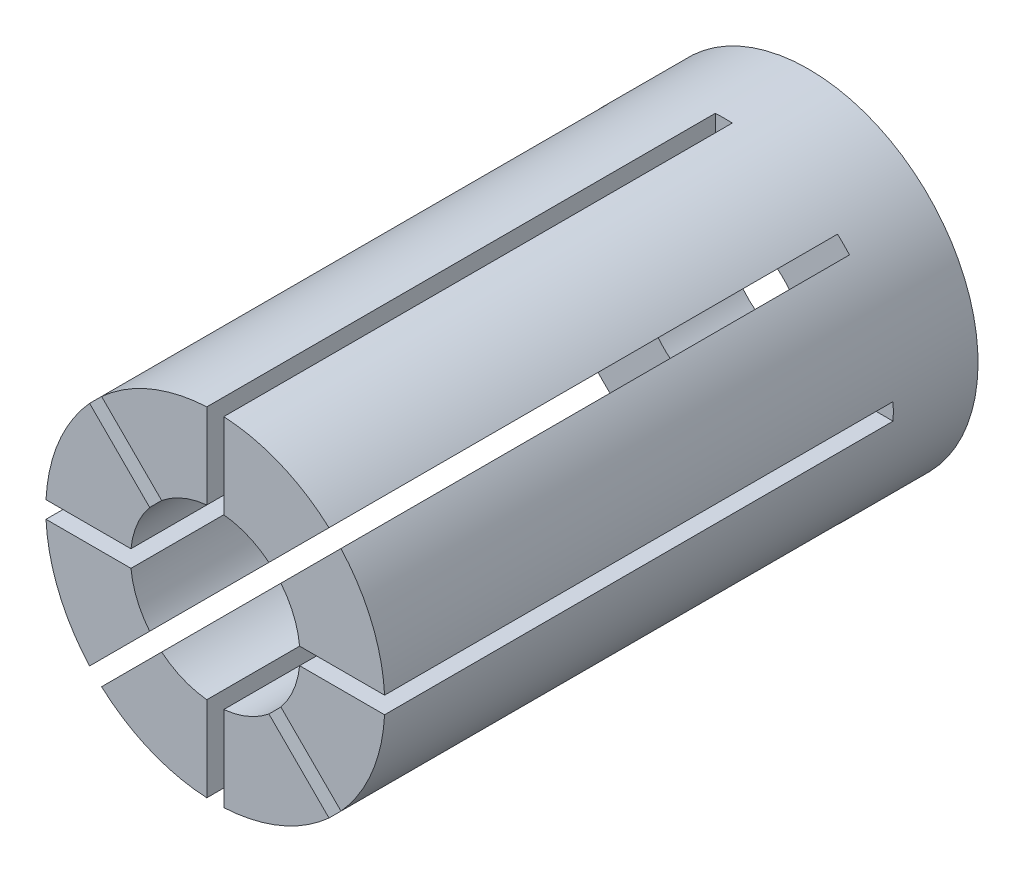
ISO-10303-21;
HEADER;
FILE_DESCRIPTION(('STEP AP214'),'2;1');
FILE_NAME('part.step','',(''),(''),'','','');
FILE_SCHEMA(('AUTOMOTIVE_DESIGN { 1 0 10303 214 1 1 1 1 }'));
ENDSEC;
DATA;
#1=APPLICATION_CONTEXT('core data for automotive mechanical design processes');
#2=APPLICATION_PROTOCOL_DEFINITION('international standard','automotive_design',2000,#1);
#3=PRODUCT_CONTEXT('',#1,'mechanical');
#4=PRODUCT('Part','Part','',(#3));
#5=PRODUCT_RELATED_PRODUCT_CATEGORY('part','',(#4));
#6=PRODUCT_DEFINITION_FORMATION('','',#4);
#7=PRODUCT_DEFINITION_CONTEXT('part definition',#1,'design');
#8=PRODUCT_DEFINITION('design','',#6,#7);
#9=PRODUCT_DEFINITION_SHAPE('','',#8);
#10=(LENGTH_UNIT() NAMED_UNIT(*) SI_UNIT(.MILLI.,.METRE.));
#11=(NAMED_UNIT(*) PLANE_ANGLE_UNIT() SI_UNIT($,.RADIAN.));
#12=(NAMED_UNIT(*) SI_UNIT($,.STERADIAN.) SOLID_ANGLE_UNIT());
#13=UNCERTAINTY_MEASURE_WITH_UNIT(LENGTH_MEASURE(1.E-05),#10,'distance_accuracy_value','');
#14=(GEOMETRIC_REPRESENTATION_CONTEXT(3) GLOBAL_UNCERTAINTY_ASSIGNED_CONTEXT((#13)) GLOBAL_UNIT_ASSIGNED_CONTEXT((#10,
#11,#12)) REPRESENTATION_CONTEXT('',''));
#15=CARTESIAN_POINT('',(0.,0.,0.));
#16=DIRECTION('',(0.,0.,1.));
#17=DIRECTION('',(1.,0.,0.));
#18=AXIS2_PLACEMENT_3D('',#15,#16,#17);
#19=CARTESIAN_POINT('',(0.998749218,0.05,0.5));
#20=DIRECTION('',(0.,1.,0.));
#21=DIRECTION('',(-1.,0.,0.));
#22=AXIS2_PLACEMENT_3D('',#19,#20,#21);
#23=PLANE('',#22);
#24=DIRECTION('',(0.,0.,1.));
#25=VECTOR('',#24,1.);
#26=CARTESIAN_POINT('',(0.497493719,0.05,2.));
#27=LINE('',#26,#25);
#28=CARTESIAN_POINT('',(0.497493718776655,0.05,0.50000000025));
#29=VERTEX_POINT('',#28);
#30=CARTESIAN_POINT('',(0.497493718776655,0.05,3.5));
#31=VERTEX_POINT('',#30);
#32=EDGE_CURVE('E281',#29,#31,#27,.T.);
#33=ORIENTED_EDGE('',*,*,#32,.F.);
#34=DIRECTION('',(-1.,0.,0.));
#35=VECTOR('',#34,1.);
#36=CARTESIAN_POINT('',(0.7481214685,0.05,0.5));
#37=LINE('',#36,#35);
#38=CARTESIAN_POINT('',(0.998749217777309,0.0499999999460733,0.50000000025));
#39=VERTEX_POINT('',#38);
#40=EDGE_CURVE('E253',#39,#29,#37,.T.);
#41=ORIENTED_EDGE('',*,*,#40,.F.);
#42=DIRECTION('',(0.,0.,-1.));
#43=VECTOR('',#42,1.);
#44=CARTESIAN_POINT('',(0.998749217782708,0.0499999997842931,1.75));
#45=LINE('',#44,#43);
#46=CARTESIAN_POINT('',(0.998749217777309,0.0499999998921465,3.5));
#47=VERTEX_POINT('',#46);
#48=EDGE_CURVE('E376',#39,#47,#45,.F.);
#49=ORIENTED_EDGE('',*,*,#48,.T.);
#50=DIRECTION('',(1.,0.,0.));
#51=VECTOR('',#50,1.);
#52=CARTESIAN_POINT('',(0.6929428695,0.05,3.5));
#53=LINE('',#52,#51);
#54=EDGE_CURVE('E283',#31,#47,#53,.T.);
#55=ORIENTED_EDGE('',*,*,#54,.F.);
#56=EDGE_LOOP('',(#33,#41,#49,#55));
#57=FACE_BOUND('',#56,.T.);
#58=ADVANCED_FACE('F17',(#57),#23,.F.);
#59=CARTESIAN_POINT('',(0.383466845,0.05,3.5));
#60=DIRECTION('',(0.,0.,1.));
#61=DIRECTION('',(1.,0.,0.));
#62=AXIS2_PLACEMENT_3D('',#59,#60,#61);
#63=PLANE('',#62);
#64=DIRECTION('',(-0.707106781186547,-0.707106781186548,0.));
#65=VECTOR('',#64,1.);
#66=CARTESIAN_POINT('',(0.5643571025,0.4936464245,3.5));
#67=LINE('',#66,#65);
#68=CARTESIAN_POINT('',(0.741577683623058,0.670867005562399,3.5));
#69=VERTEX_POINT('',#68);
#70=CARTESIAN_POINT('',(0.38713652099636,0.31642584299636,3.5));
#71=VERTEX_POINT('',#70);
#72=EDGE_CURVE('E280',#69,#71,#67,.T.);
#73=ORIENTED_EDGE('',*,*,#72,.T.);
#74=CARTESIAN_POINT('',(0.,0.,3.5));
#75=DIRECTION('',(0.,0.,-1.));
#76=DIRECTION('',(0.,1.,0.));
#77=AXIS2_PLACEMENT_3D('',#74,#75,#76);
#78=CIRCLE('',#77,0.5);
#79=EDGE_CURVE('E21',#71,#31,#78,.T.);
#80=ORIENTED_EDGE('',*,*,#79,.T.);
#81=ORIENTED_EDGE('',*,*,#54,.T.);
#82=CARTESIAN_POINT('',(0.,0.,3.5));
#83=DIRECTION('',(0.,0.,-1.));
#84=DIRECTION('',(0.,1.,0.));
#85=AXIS2_PLACEMENT_3D('',#82,#83,#84);
#86=CIRCLE('',#85,1.);
#87=EDGE_CURVE('E374',#47,#69,#86,.F.);
#88=ORIENTED_EDGE('',*,*,#87,.T.);
#89=EDGE_LOOP('',(#73,#80,#81,#88));
#90=FACE_BOUND('',#89,.T.);
#91=ADVANCED_FACE('F482',(#90),#63,.T.);
#92=CARTESIAN_POINT('',(0.387136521,0.316425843,0.5));
#93=DIRECTION('',(0.707106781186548,-0.707106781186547,0.));
#94=DIRECTION('',(0.707106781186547,0.707106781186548,0.));
#95=AXIS2_PLACEMENT_3D('',#92,#93,#94);
#96=PLANE('',#95);
#97=DIRECTION('',(0.,0.,1.));
#98=VECTOR('',#97,1.);
#99=CARTESIAN_POINT('',(0.741577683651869,0.670867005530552,1.75));
#100=LINE('',#99,#98);
#101=CARTESIAN_POINT('',(0.741577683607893,0.670867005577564,0.50000000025));
#102=VERTEX_POINT('',#101);
#103=EDGE_CURVE('E373',#69,#102,#100,.F.);
#104=ORIENTED_EDGE('',*,*,#103,.T.);
#105=DIRECTION('',(0.707106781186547,0.707106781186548,0.));
#106=VECTOR('',#105,1.);
#107=CARTESIAN_POINT('',(0.5647993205,0.4940886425,0.5));
#108=LINE('',#107,#106);
#109=CARTESIAN_POINT('',(0.38713652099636,0.31642584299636,0.50000000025));
#110=VERTEX_POINT('',#109);
#111=EDGE_CURVE('E389',#110,#102,#108,.T.);
#112=ORIENTED_EDGE('',*,*,#111,.F.);
#113=DIRECTION('',(0.,0.,-1.));
#114=VECTOR('',#113,1.);
#115=CARTESIAN_POINT('',(0.387136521,0.316425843,2.));
#116=LINE('',#115,#114);
#117=EDGE_CURVE('E277',#71,#110,#116,.T.);
#118=ORIENTED_EDGE('',*,*,#117,.F.);
#119=ORIENTED_EDGE('',*,*,#72,.F.);
#120=EDGE_LOOP('',(#104,#112,#118,#119));
#121=FACE_BOUND('',#120,.T.);
#122=ADVANCED_FACE('F496',(#121),#96,.F.);
#123=CARTESIAN_POINT('',(0.314293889,0.385004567,0.5));
#124=DIRECTION('',(0.,0.,1.));
#125=DIRECTION('',(0.707106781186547,-0.707106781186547,0.));
#126=AXIS2_PLACEMENT_3D('',#123,#124,#125);
#127=PLANE('',#126);
#128=CARTESIAN_POINT('',(0.,0.,0.500000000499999));
#129=DIRECTION('',(0.,0.,-1.));
#130=DIRECTION('',(0.,1.,0.));
#131=AXIS2_PLACEMENT_3D('',#128,#129,#130);
#132=CIRCLE('',#131,0.5);
#133=CARTESIAN_POINT('',(0.31642584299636,0.38713652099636,0.50000000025));
#134=VERTEX_POINT('',#133);
#135=EDGE_CURVE('E388',#134,#110,#132,.T.);
#136=ORIENTED_EDGE('',*,*,#135,.T.);
#137=ORIENTED_EDGE('',*,*,#111,.T.);
#138=CARTESIAN_POINT('',(0.,0.,0.500000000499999));
#139=DIRECTION('',(0.,0.,-1.));
#140=DIRECTION('',(0.,1.,0.));
#141=AXIS2_PLACEMENT_3D('',#138,#139,#140);
#142=CIRCLE('',#141,1.);
#143=CARTESIAN_POINT('',(0.670867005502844,0.741577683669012,0.50000000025));
#144=VERTEX_POINT('',#143);
#145=EDGE_CURVE('E370',#102,#144,#142,.F.);
#146=ORIENTED_EDGE('',*,*,#145,.T.);
#147=DIRECTION('',(-0.707106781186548,-0.707106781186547,0.));
#148=VECTOR('',#147,1.);
#149=CARTESIAN_POINT('',(0.4936464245,0.5643571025,0.5));
#150=LINE('',#149,#148);
#151=EDGE_CURVE('E276',#144,#134,#150,.T.);
#152=ORIENTED_EDGE('',*,*,#151,.T.);
#153=EDGE_LOOP('',(#136,#137,#146,#152));
#154=FACE_BOUND('',#153,.T.);
#155=ADVANCED_FACE('F502',(#154),#127,.T.);
#156=CARTESIAN_POINT('',(0.670867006,0.741577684,0.5));
#157=DIRECTION('',(-0.707106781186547,0.707106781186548,0.));
#158=DIRECTION('',(-0.707106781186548,-0.707106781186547,0.));
#159=AXIS2_PLACEMENT_3D('',#156,#157,#158);
#160=PLANE('',#159);
#161=DIRECTION('',(0.,0.,1.));
#162=VECTOR('',#161,1.);
#163=CARTESIAN_POINT('',(0.316425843,0.387136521,2.));
#164=LINE('',#163,#162);
#165=CARTESIAN_POINT('',(0.316425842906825,0.387136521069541,3.5));
#166=VERTEX_POINT('',#165);
#167=EDGE_CURVE('E273',#134,#166,#164,.T.);
#168=ORIENTED_EDGE('',*,*,#167,.F.);
#169=ORIENTED_EDGE('',*,*,#151,.F.);
#170=DIRECTION('',(0.,0.,-1.));
#171=VECTOR('',#170,1.);
#172=CARTESIAN_POINT('',(0.670867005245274,0.741577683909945,1.75));
#173=LINE('',#172,#171);
#174=CARTESIAN_POINT('',(0.670867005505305,0.741577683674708,3.5));
#175=VERTEX_POINT('',#174);
#176=EDGE_CURVE('E369',#144,#175,#173,.F.);
#177=ORIENTED_EDGE('',*,*,#176,.T.);
#178=DIRECTION('',(0.707106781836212,0.707106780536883,0.));
#179=VECTOR('',#178,1.);
#180=CARTESIAN_POINT('',(0.31642584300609,0.387136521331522,3.5));
#181=LINE('',#180,#179);
#182=EDGE_CURVE('E275',#166,#175,#181,.T.);
#183=ORIENTED_EDGE('',*,*,#182,.F.);
#184=EDGE_LOOP('',(#168,#169,#177,#183));
#185=FACE_BOUND('',#184,.T.);
#186=ADVANCED_FACE('F501',(#185),#160,.F.);
#187=CARTESIAN_POINT('',(0.05,0.383466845,3.5));
#188=DIRECTION('',(0.,0.,1.));
#189=DIRECTION('',(1.,0.,0.));
#190=AXIS2_PLACEMENT_3D('',#187,#188,#189);
#191=PLANE('',#190);
#192=DIRECTION('',(0.,-1.,0.));
#193=VECTOR('',#192,1.);
#194=CARTESIAN_POINT('',(0.05,0.7481214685,3.5));
#195=LINE('',#194,#193);
#196=CARTESIAN_POINT('',(0.0500000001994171,0.998749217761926,3.5));
#197=VERTEX_POINT('',#196);
#198=CARTESIAN_POINT('',(0.05,0.497493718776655,3.5));
#199=VERTEX_POINT('',#198);
#200=EDGE_CURVE('E271',#197,#199,#195,.T.);
#201=ORIENTED_EDGE('',*,*,#200,.T.);
#202=CARTESIAN_POINT('',(0.,0.,3.5));
#203=DIRECTION('',(0.,0.,-1.));
#204=DIRECTION('',(0.,1.,0.));
#205=AXIS2_PLACEMENT_3D('',#202,#203,#204);
#206=CIRCLE('',#205,0.5);
#207=EDGE_CURVE('E272',#199,#166,#206,.T.);
#208=ORIENTED_EDGE('',*,*,#207,.T.);
#209=ORIENTED_EDGE('',*,*,#182,.T.);
#210=CARTESIAN_POINT('',(0.,0.,3.5));
#211=DIRECTION('',(0.,0.,-1.));
#212=DIRECTION('',(0.,1.,0.));
#213=AXIS2_PLACEMENT_3D('',#210,#211,#212);
#214=CIRCLE('',#213,1.);
#215=EDGE_CURVE('E366',#175,#197,#214,.F.);
#216=ORIENTED_EDGE('',*,*,#215,.T.);
#217=EDGE_LOOP('',(#201,#208,#209,#216));
#218=FACE_BOUND('',#217,.T.);
#219=ADVANCED_FACE('F510',(#218),#191,.T.);
#220=CARTESIAN_POINT('',(0.05,0.497493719,0.5));
#221=DIRECTION('',(1.,0.,0.));
#222=DIRECTION('',(0.,1.,0.));
#223=AXIS2_PLACEMENT_3D('',#220,#221,#222);
#224=PLANE('',#223);
#225=DIRECTION('',(0.,0.,1.));
#226=VECTOR('',#225,1.);
#227=CARTESIAN_POINT('',(0.0500000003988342,0.998749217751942,1.75));
#228=LINE('',#227,#226);
#229=CARTESIAN_POINT('',(0.0500000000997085,0.998749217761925,0.50000000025));
#230=VERTEX_POINT('',#229);
#231=EDGE_CURVE('E365',#197,#230,#228,.F.);
#232=ORIENTED_EDGE('',*,*,#231,.T.);
#233=DIRECTION('',(0.,1.,0.));
#234=VECTOR('',#233,1.);
#235=CARTESIAN_POINT('',(0.05,0.7487468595,0.5));
#236=LINE('',#235,#234);
#237=CARTESIAN_POINT('',(0.05,0.497493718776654,0.50000000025));
#238=VERTEX_POINT('',#237);
#239=EDGE_CURVE('E385',#238,#230,#236,.T.);
#240=ORIENTED_EDGE('',*,*,#239,.F.);
#241=DIRECTION('',(0.,0.,-1.));
#242=VECTOR('',#241,1.);
#243=CARTESIAN_POINT('',(0.05,0.497493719,2.));
#244=LINE('',#243,#242);
#245=EDGE_CURVE('E268',#199,#238,#244,.T.);
#246=ORIENTED_EDGE('',*,*,#245,.F.);
#247=ORIENTED_EDGE('',*,*,#200,.F.);
#248=EDGE_LOOP('',(#232,#240,#246,#247));
#249=FACE_BOUND('',#248,.T.);
#250=ADVANCED_FACE('F542',(#249),#224,.F.);
#251=CARTESIAN_POINT('',(-0.05,0.494478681,0.5));
#252=DIRECTION('',(0.,0.,1.));
#253=DIRECTION('',(1.,0.,0.));
#254=AXIS2_PLACEMENT_3D('',#251,#252,#253);
#255=PLANE('',#254);
#256=CARTESIAN_POINT('',(0.,0.,0.500000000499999));
#257=DIRECTION('',(0.,0.,-1.));
#258=DIRECTION('',(0.,1.,0.));
#259=AXIS2_PLACEMENT_3D('',#256,#257,#258);
#260=CIRCLE('',#259,0.5);
#261=CARTESIAN_POINT('',(-0.05,0.497493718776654,0.50000000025));
#262=VERTEX_POINT('',#261);
#263=EDGE_CURVE('E383',#262,#238,#260,.T.);
#264=ORIENTED_EDGE('',*,*,#263,.T.);
#265=ORIENTED_EDGE('',*,*,#239,.T.);
#266=CARTESIAN_POINT('',(0.,0.,0.500000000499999));
#267=DIRECTION('',(0.,0.,-1.));
#268=DIRECTION('',(0.,1.,0.));
#269=AXIS2_PLACEMENT_3D('',#266,#267,#268);
#270=CIRCLE('',#269,1.);
#271=CARTESIAN_POINT('',(-0.0499999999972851,0.99874921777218,0.50000000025));
#272=VERTEX_POINT('',#271);
#273=EDGE_CURVE('E362',#230,#272,#270,.F.);
#274=ORIENTED_EDGE('',*,*,#273,.T.);
#275=DIRECTION('',(0.,-1.,0.));
#276=VECTOR('',#275,1.);
#277=CARTESIAN_POINT('',(-0.05,0.7481214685,0.5));
#278=LINE('',#277,#276);
#279=EDGE_CURVE('E267',#272,#262,#278,.T.);
#280=ORIENTED_EDGE('',*,*,#279,.T.);
#281=EDGE_LOOP('',(#264,#265,#274,#280));
#282=FACE_BOUND('',#281,.T.);
#283=ADVANCED_FACE('F550',(#282),#255,.T.);
#284=CARTESIAN_POINT('',(-0.05,0.998749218,0.5));
#285=DIRECTION('',(-1.,0.,0.));
#286=DIRECTION('',(0.,-1.,0.));
#287=AXIS2_PLACEMENT_3D('',#284,#285,#286);
#288=PLANE('',#287);
#289=DIRECTION('',(0.,0.,1.));
#290=VECTOR('',#289,1.);
#291=CARTESIAN_POINT('',(-0.05,0.497493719,2.));
#292=LINE('',#291,#290);
#293=CARTESIAN_POINT('',(-0.05,0.497493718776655,3.5));
#294=VERTEX_POINT('',#293);
#295=EDGE_CURVE('E263',#262,#294,#292,.T.);
#296=ORIENTED_EDGE('',*,*,#295,.F.);
#297=ORIENTED_EDGE('',*,*,#279,.F.);
#298=DIRECTION('',(0.,0.,-1.));
#299=VECTOR('',#298,1.);
#300=CARTESIAN_POINT('',(-0.0499999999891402,0.998749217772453,1.75));
#301=LINE('',#300,#299);
#302=CARTESIAN_POINT('',(-0.0499999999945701,0.998749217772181,3.5));
#303=VERTEX_POINT('',#302);
#304=EDGE_CURVE('E361',#272,#303,#301,.F.);
#305=ORIENTED_EDGE('',*,*,#304,.T.);
#306=DIRECTION('',(0.,1.,0.));
#307=VECTOR('',#306,1.);
#308=CARTESIAN_POINT('',(-0.05,0.6929428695,3.5));
#309=LINE('',#308,#307);
#310=EDGE_CURVE('E262',#294,#303,#309,.T.);
#311=ORIENTED_EDGE('',*,*,#310,.F.);
#312=EDGE_LOOP('',(#296,#297,#305,#311));
#313=FACE_BOUND('',#312,.T.);
#314=ADVANCED_FACE('F558',(#313),#288,.F.);
#315=CARTESIAN_POINT('',(-0.674592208,0.383466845,3.5));
#316=DIRECTION('',(0.,0.,1.));
#317=DIRECTION('',(1.,0.,0.));
#318=AXIS2_PLACEMENT_3D('',#315,#316,#317);
#319=PLANE('',#318);
#320=ORIENTED_EDGE('',*,*,#310,.T.);
#321=CARTESIAN_POINT('',(0.,0.,3.5));
#322=DIRECTION('',(0.,0.,-1.));
#323=DIRECTION('',(0.,1.,0.));
#324=AXIS2_PLACEMENT_3D('',#321,#322,#323);
#325=CIRCLE('',#324,1.);
#326=CARTESIAN_POINT('',(-0.670867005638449,0.741577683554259,3.5));
#327=VERTEX_POINT('',#326);
#328=EDGE_CURVE('E358',#303,#327,#325,.F.);
#329=ORIENTED_EDGE('',*,*,#328,.T.);
#330=DIRECTION('',(0.707106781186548,-0.707106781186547,0.));
#331=VECTOR('',#330,1.);
#332=CARTESIAN_POINT('',(-0.4936464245,0.5643571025,3.5));
#333=LINE('',#332,#331);
#334=CARTESIAN_POINT('',(-0.31642584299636,0.38713652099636,3.5));
#335=VERTEX_POINT('',#334);
#336=EDGE_CURVE('E261',#327,#335,#333,.T.);
#337=ORIENTED_EDGE('',*,*,#336,.T.);
#338=CARTESIAN_POINT('',(0.,0.,3.5));
#339=DIRECTION('',(0.,0.,-1.));
#340=DIRECTION('',(0.,1.,0.));
#341=AXIS2_PLACEMENT_3D('',#338,#339,#340);
#342=CIRCLE('',#341,0.5);
#343=EDGE_CURVE('E266',#335,#294,#342,.T.);
#344=ORIENTED_EDGE('',*,*,#343,.T.);
#345=EDGE_LOOP('',(#320,#329,#337,#344));
#346=FACE_BOUND('',#345,.T.);
#347=ADVANCED_FACE('F566',(#346),#319,.T.);
#348=CARTESIAN_POINT('',(-0.316425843,0.387136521,0.5));
#349=DIRECTION('',(0.707106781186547,0.707106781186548,0.));
#350=DIRECTION('',(-0.707106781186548,0.707106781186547,0.));
#351=AXIS2_PLACEMENT_3D('',#348,#349,#350);
#352=PLANE('',#351);
#353=DIRECTION('',(0.,0.,1.));
#354=VECTOR('',#353,1.);
#355=CARTESIAN_POINT('',(-0.670867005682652,0.741577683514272,1.75));
#356=LINE('',#355,#354);
#357=CARTESIAN_POINT('',(-0.670867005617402,0.741577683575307,0.50000000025));
#358=VERTEX_POINT('',#357);
#359=EDGE_CURVE('E357',#327,#358,#356,.F.);
#360=ORIENTED_EDGE('',*,*,#359,.T.);
#361=DIRECTION('',(-0.707106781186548,0.707106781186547,0.));
#362=VECTOR('',#361,1.);
#363=CARTESIAN_POINT('',(-0.4940886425,0.5647993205,0.5));
#364=LINE('',#363,#362);
#365=CARTESIAN_POINT('',(-0.31642584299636,0.38713652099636,0.50000000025));
#366=VERTEX_POINT('',#365);
#367=EDGE_CURVE('E381',#366,#358,#364,.T.);
#368=ORIENTED_EDGE('',*,*,#367,.F.);
#369=DIRECTION('',(0.,0.,-1.));
#370=VECTOR('',#369,1.);
#371=CARTESIAN_POINT('',(-0.316425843,0.387136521,2.));
#372=LINE('',#371,#370);
#373=EDGE_CURVE('E258',#335,#366,#372,.T.);
#374=ORIENTED_EDGE('',*,*,#373,.F.);
#375=ORIENTED_EDGE('',*,*,#336,.F.);
#376=EDGE_LOOP('',(#360,#368,#374,#375));
#377=FACE_BOUND('',#376,.T.);
#378=ADVANCED_FACE('F574',(#377),#352,.F.);
#379=CARTESIAN_POINT('',(-0.385004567,0.314293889,0.5));
#380=DIRECTION('',(0.,0.,1.));
#381=DIRECTION('',(0.707106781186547,0.707106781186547,0.));
#382=AXIS2_PLACEMENT_3D('',#379,#380,#381);
#383=PLANE('',#382);
#384=CARTESIAN_POINT('',(0.,0.,0.500000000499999));
#385=DIRECTION('',(0.,0.,-1.));
#386=DIRECTION('',(0.,1.,0.));
#387=AXIS2_PLACEMENT_3D('',#384,#385,#386);
#388=CIRCLE('',#387,0.5);
#389=CARTESIAN_POINT('',(-0.38713652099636,0.31642584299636,0.50000000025));
#390=VERTEX_POINT('',#389);
#391=EDGE_CURVE('E379',#390,#366,#388,.T.);
#392=ORIENTED_EDGE('',*,*,#391,.T.);
#393=ORIENTED_EDGE('',*,*,#367,.T.);
#394=CARTESIAN_POINT('',(0.,0.,0.500000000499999));
#395=DIRECTION('',(0.,0.,-1.));
#396=DIRECTION('',(0.,1.,0.));
#397=AXIS2_PLACEMENT_3D('',#394,#395,#396);
#398=CIRCLE('',#397,1.);
#399=CARTESIAN_POINT('',(-0.74157768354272,0.67086700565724,0.50000000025));
#400=VERTEX_POINT('',#399);
#401=EDGE_CURVE('E354',#358,#400,#398,.F.);
#402=ORIENTED_EDGE('',*,*,#401,.T.);
#403=DIRECTION('',(0.707106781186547,-0.707106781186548,0.));
#404=VECTOR('',#403,1.);
#405=CARTESIAN_POINT('',(-0.5643571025,0.4936464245,0.5));
#406=LINE('',#405,#404);
#407=EDGE_CURVE('E257',#400,#390,#406,.T.);
#408=ORIENTED_EDGE('',*,*,#407,.T.);
#409=EDGE_LOOP('',(#392,#393,#402,#408));
#410=FACE_BOUND('',#409,.T.);
#411=ADVANCED_FACE('F582',(#410),#383,.T.);
#412=CARTESIAN_POINT('',(-0.741577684,0.670867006,0.5));
#413=DIRECTION('',(-0.707106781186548,-0.707106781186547,0.));
#414=DIRECTION('',(0.707106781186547,-0.707106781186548,0.));
#415=AXIS2_PLACEMENT_3D('',#412,#413,#414);
#416=PLANE('',#415);
#417=DIRECTION('',(0.,0.,1.));
#418=VECTOR('',#417,1.);
#419=CARTESIAN_POINT('',(-0.387136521,0.316425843,2.));
#420=LINE('',#419,#418);
#421=CARTESIAN_POINT('',(-0.387136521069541,0.316425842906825,3.5));
#422=VERTEX_POINT('',#421);
#423=EDGE_CURVE('E255',#390,#422,#420,.T.);
#424=ORIENTED_EDGE('',*,*,#423,.F.);
#425=ORIENTED_EDGE('',*,*,#407,.F.);
#426=DIRECTION('',(0.,0.,-1.));
#427=VECTOR('',#426,1.);
#428=CARTESIAN_POINT('',(-0.741577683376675,0.670867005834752,1.75));
#429=LINE('',#428,#427);
#430=CARTESIAN_POINT('',(-0.741577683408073,0.670867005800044,3.5));
#431=VERTEX_POINT('',#430);
#432=EDGE_CURVE('E353',#400,#431,#429,.F.);
#433=ORIENTED_EDGE('',*,*,#432,.T.);
#434=DIRECTION('',(-0.707106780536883,0.707106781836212,0.));
#435=VECTOR('',#434,1.);
#436=CARTESIAN_POINT('',(-0.387136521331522,0.31642584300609,3.5));
#437=LINE('',#436,#435);
#438=EDGE_CURVE('E249',#422,#431,#437,.T.);
#439=ORIENTED_EDGE('',*,*,#438,.F.);
#440=EDGE_LOOP('',(#424,#425,#433,#439));
#441=FACE_BOUND('',#440,.T.);
#442=ADVANCED_FACE('F590',(#441),#416,.F.);
#443=CARTESIAN_POINT('',(-1.002418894,0.05,3.5));
#444=DIRECTION('',(0.,0.,1.));
#445=DIRECTION('',(1.,0.,0.));
#446=AXIS2_PLACEMENT_3D('',#443,#444,#445);
#447=PLANE('',#446);
#448=DIRECTION('',(1.,0.,0.));
#449=VECTOR('',#448,1.);
#450=CARTESIAN_POINT('',(-0.7481214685,0.05,3.5));
#451=LINE('',#450,#449);
#452=CARTESIAN_POINT('',(-0.998749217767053,0.0500000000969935,3.5));
#453=VERTEX_POINT('',#452);
#454=CARTESIAN_POINT('',(-0.497493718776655,0.05,3.5));
#455=VERTEX_POINT('',#454);
#456=EDGE_CURVE('E240',#453,#455,#451,.T.);
#457=ORIENTED_EDGE('',*,*,#456,.T.);
#458=CARTESIAN_POINT('',(0.,0.,3.5));
#459=DIRECTION('',(0.,0.,-1.));
#460=DIRECTION('',(0.,1.,0.));
#461=AXIS2_PLACEMENT_3D('',#458,#459,#460);
#462=CIRCLE('',#461,0.5);
#463=EDGE_CURVE('E246',#455,#422,#462,.T.);
#464=ORIENTED_EDGE('',*,*,#463,.T.);
#465=ORIENTED_EDGE('',*,*,#438,.T.);
#466=CARTESIAN_POINT('',(0.,0.,3.5));
#467=DIRECTION('',(0.,0.,-1.));
#468=DIRECTION('',(0.,1.,0.));
#469=AXIS2_PLACEMENT_3D('',#466,#467,#468);
#470=CIRCLE('',#469,1.);
#471=EDGE_CURVE('E350',#431,#453,#470,.F.);
#472=ORIENTED_EDGE('',*,*,#471,.T.);
#473=EDGE_LOOP('',(#457,#464,#465,#472));
#474=FACE_BOUND('',#473,.T.);
#475=ADVANCED_FACE('F598',(#474),#447,.T.);
#476=CARTESIAN_POINT('',(-0.497493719,0.05,0.5));
#477=DIRECTION('',(0.,1.,0.));
#478=DIRECTION('',(-1.,0.,0.));
#479=AXIS2_PLACEMENT_3D('',#476,#477,#478);
#480=PLANE('',#479);
#481=DIRECTION('',(0.,0.,1.));
#482=VECTOR('',#481,1.);
#483=CARTESIAN_POINT('',(-0.998749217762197,0.0500000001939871,1.75));
#484=LINE('',#483,#482);
#485=CARTESIAN_POINT('',(-0.998749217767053,0.0500000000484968,0.50000000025));
#486=VERTEX_POINT('',#485);
#487=EDGE_CURVE('E239',#453,#486,#484,.F.);
#488=ORIENTED_EDGE('',*,*,#487,.T.);
#489=DIRECTION('',(-1.,0.,0.));
#490=VECTOR('',#489,1.);
#491=CARTESIAN_POINT('',(-0.7481214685,0.05,0.5));
#492=LINE('',#491,#490);
#493=CARTESIAN_POINT('',(-0.497493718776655,0.05,0.50000000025));
#494=VERTEX_POINT('',#493);
#495=EDGE_CURVE('E225',#494,#486,#492,.T.);
#496=ORIENTED_EDGE('',*,*,#495,.F.);
#497=DIRECTION('',(0.,0.,-1.));
#498=VECTOR('',#497,1.);
#499=CARTESIAN_POINT('',(-0.497493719,0.05,2.));
#500=LINE('',#499,#498);
#501=EDGE_CURVE('E236',#455,#494,#500,.T.);
#502=ORIENTED_EDGE('',*,*,#501,.F.);
#503=ORIENTED_EDGE('',*,*,#456,.F.);
#504=EDGE_LOOP('',(#488,#496,#502,#503));
#505=FACE_BOUND('',#504,.T.);
#506=ADVANCED_FACE('F235',(#505),#480,.F.);
#507=CARTESIAN_POINT('',(-1.012,-1.012,0.));
#508=DIRECTION('',(0.,0.,1.));
#509=DIRECTION('',(1.,0.,0.));
#510=AXIS2_PLACEMENT_3D('',#507,#508,#509);
#511=PLANE('',#510);
#512=CARTESIAN_POINT('',(0.,0.,0.));
#513=DIRECTION('',(0.,0.,-1.));
#514=DIRECTION('',(0.,1.,0.));
#515=AXIS2_PLACEMENT_3D('',#512,#513,#514);
#516=CIRCLE('',#515,0.5);
#517=CARTESIAN_POINT('',(0.,0.499999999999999,0.));
#518=VERTEX_POINT('',#517);
#519=EDGE_CURVE('E347',#518,#518,#516,.T.);
#520=ORIENTED_EDGE('',*,*,#519,.F.);
#521=EDGE_LOOP('',(#520));
#522=FACE_BOUND('',#521,.T.);
#523=CARTESIAN_POINT('',(0.,0.,0.));
#524=DIRECTION('',(0.,0.,-1.));
#525=DIRECTION('',(0.,1.,0.));
#526=AXIS2_PLACEMENT_3D('',#523,#524,#525);
#527=CIRCLE('',#526,1.);
#528=CARTESIAN_POINT('',(0.,0.999999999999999,0.));
#529=VERTEX_POINT('',#528);
#530=EDGE_CURVE('E344',#529,#529,#527,.T.);
#531=ORIENTED_EDGE('',*,*,#530,.T.);
#532=EDGE_LOOP('',(#531));
#533=FACE_BOUND('',#532,.T.);
#534=ADVANCED_FACE('F613',(#522,#533),#511,.F.);
#535=CARTESIAN_POINT('',(0.,0.,3.5));
#536=DIRECTION('',(0.,0.,-1.));
#537=DIRECTION('',(0.,1.,0.));
#538=AXIS2_PLACEMENT_3D('',#535,#536,#537);
#539=CYLINDRICAL_SURFACE('',#538,1.);
#540=ORIENTED_EDGE('',*,*,#530,.F.);
#541=EDGE_LOOP('',(#540));
#542=FACE_BOUND('',#541,.T.);
#543=CARTESIAN_POINT('',(0.,0.,0.500000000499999));
#544=DIRECTION('',(0.,0.,-1.));
#545=DIRECTION('',(0.,1.,0.));
#546=AXIS2_PLACEMENT_3D('',#543,#544,#545);
#547=CIRCLE('',#546,1.);
#548=CARTESIAN_POINT('',(0.998749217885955,-0.05,0.50000000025));
#549=VERTEX_POINT('',#548);
#550=EDGE_CURVE('E342',#549,#39,#547,.F.);
#551=ORIENTED_EDGE('',*,*,#550,.F.);
#552=DIRECTION('',(0.,0.,1.));
#553=VECTOR('',#552,1.);
#554=CARTESIAN_POINT('',(0.998749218,-0.05,2.));
#555=LINE('',#554,#553);
#556=CARTESIAN_POINT('',(0.998749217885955,-0.05,3.5));
#557=VERTEX_POINT('',#556);
#558=EDGE_CURVE('E440',#549,#557,#555,.T.);
#559=ORIENTED_EDGE('',*,*,#558,.T.);
#560=CARTESIAN_POINT('',(0.,0.,3.5));
#561=DIRECTION('',(0.,0.,-1.));
#562=DIRECTION('',(0.,1.,0.));
#563=AXIS2_PLACEMENT_3D('',#560,#561,#562);
#564=CIRCLE('',#563,1.);
#565=CARTESIAN_POINT('',(0.741577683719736,-0.670867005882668,3.5));
#566=VERTEX_POINT('',#565);
#567=EDGE_CURVE('E305',#566,#557,#564,.F.);
#568=ORIENTED_EDGE('',*,*,#567,.F.);
#569=DIRECTION('',(0.,0.,-1.));
#570=VECTOR('',#569,1.);
#571=CARTESIAN_POINT('',(0.741577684,-0.670867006,2.));
#572=LINE('',#571,#570);
#573=CARTESIAN_POINT('',(0.741577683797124,-0.670867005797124,0.50000000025));
#574=VERTEX_POINT('',#573);
#575=EDGE_CURVE('E437',#566,#574,#572,.T.);
#576=ORIENTED_EDGE('',*,*,#575,.T.);
#577=CARTESIAN_POINT('',(0.,0.,0.500000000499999));
#578=DIRECTION('',(0.,0.,-1.));
#579=DIRECTION('',(0.,1.,0.));
#580=AXIS2_PLACEMENT_3D('',#577,#578,#579);
#581=CIRCLE('',#580,1.);
#582=CARTESIAN_POINT('',(0.670867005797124,-0.741577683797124,0.50000000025));
#583=VERTEX_POINT('',#582);
#584=EDGE_CURVE('E312',#583,#574,#581,.F.);
#585=ORIENTED_EDGE('',*,*,#584,.F.);
#586=DIRECTION('',(0.,0.,1.));
#587=VECTOR('',#586,1.);
#588=CARTESIAN_POINT('',(0.670867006,-0.741577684,2.));
#589=LINE('',#588,#587);
#590=CARTESIAN_POINT('',(0.670867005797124,-0.741577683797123,3.5));
#591=VERTEX_POINT('',#590);
#592=EDGE_CURVE('E318',#583,#591,#589,.T.);
#593=ORIENTED_EDGE('',*,*,#592,.T.);
#594=CARTESIAN_POINT('',(0.,0.,3.5));
#595=DIRECTION('',(0.,0.,-1.));
#596=DIRECTION('',(0.,1.,0.));
#597=AXIS2_PLACEMENT_3D('',#594,#595,#596);
#598=CIRCLE('',#597,1.);
#599=CARTESIAN_POINT('',(0.05,-0.998749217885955,3.5));
#600=VERTEX_POINT('',#599);
#601=EDGE_CURVE('E316',#600,#591,#598,.F.);
#602=ORIENTED_EDGE('',*,*,#601,.F.);
#603=DIRECTION('',(0.,0.,-1.));
#604=VECTOR('',#603,1.);
#605=CARTESIAN_POINT('',(0.05,-0.998749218,2.));
#606=LINE('',#605,#604);
#607=CARTESIAN_POINT('',(0.05,-0.998749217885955,0.50000000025));
#608=VERTEX_POINT('',#607);
#609=EDGE_CURVE('E431',#600,#608,#606,.T.);
#610=ORIENTED_EDGE('',*,*,#609,.T.);
#611=CARTESIAN_POINT('',(0.,0.,0.500000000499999));
#612=DIRECTION('',(0.,0.,-1.));
#613=DIRECTION('',(0.,1.,0.));
#614=AXIS2_PLACEMENT_3D('',#611,#612,#613);
#615=CIRCLE('',#614,1.);
#616=CARTESIAN_POINT('',(-0.05,-0.998749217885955,0.50000000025));
#617=VERTEX_POINT('',#616);
#618=EDGE_CURVE('E320',#617,#608,#615,.F.);
#619=ORIENTED_EDGE('',*,*,#618,.F.);
#620=DIRECTION('',(0.,0.,1.));
#621=VECTOR('',#620,1.);
#622=CARTESIAN_POINT('',(-0.05,-0.998749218,2.));
#623=LINE('',#622,#621);
#624=CARTESIAN_POINT('',(-0.05,-0.998749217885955,3.5));
#625=VERTEX_POINT('',#624);
#626=EDGE_CURVE('E326',#617,#625,#623,.T.);
#627=ORIENTED_EDGE('',*,*,#626,.T.);
#628=CARTESIAN_POINT('',(0.,0.,3.5));
#629=DIRECTION('',(0.,0.,-1.));
#630=DIRECTION('',(0.,1.,0.));
#631=AXIS2_PLACEMENT_3D('',#628,#629,#630);
#632=CIRCLE('',#631,1.);
#633=CARTESIAN_POINT('',(-0.670867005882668,-0.741577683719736,3.5));
#634=VERTEX_POINT('',#633);
#635=EDGE_CURVE('E324',#634,#625,#632,.F.);
#636=ORIENTED_EDGE('',*,*,#635,.F.);
#637=DIRECTION('',(0.,0.,-1.));
#638=VECTOR('',#637,1.);
#639=CARTESIAN_POINT('',(-0.670867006,-0.741577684,2.));
#640=LINE('',#639,#638);
#641=CARTESIAN_POINT('',(-0.670867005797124,-0.741577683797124,0.50000000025));
#642=VERTEX_POINT('',#641);
#643=EDGE_CURVE('E426',#634,#642,#640,.T.);
#644=ORIENTED_EDGE('',*,*,#643,.T.);
#645=CARTESIAN_POINT('',(0.,0.,0.500000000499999));
#646=DIRECTION('',(0.,0.,-1.));
#647=DIRECTION('',(0.,1.,0.));
#648=AXIS2_PLACEMENT_3D('',#645,#646,#647);
#649=CIRCLE('',#648,1.);
#650=CARTESIAN_POINT('',(-0.741577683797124,-0.670867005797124,0.50000000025));
#651=VERTEX_POINT('',#650);
#652=EDGE_CURVE('E331',#651,#642,#649,.F.);
#653=ORIENTED_EDGE('',*,*,#652,.F.);
#654=DIRECTION('',(0.,0.,1.));
#655=VECTOR('',#654,1.);
#656=CARTESIAN_POINT('',(-0.741577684,-0.670867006,2.));
#657=LINE('',#656,#655);
#658=CARTESIAN_POINT('',(-0.741577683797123,-0.670867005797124,3.5));
#659=VERTEX_POINT('',#658);
#660=EDGE_CURVE('E337',#651,#659,#657,.T.);
#661=ORIENTED_EDGE('',*,*,#660,.T.);
#662=CARTESIAN_POINT('',(0.,0.,3.5));
#663=DIRECTION('',(0.,0.,-1.));
#664=DIRECTION('',(0.,1.,0.));
#665=AXIS2_PLACEMENT_3D('',#662,#663,#664);
#666=CIRCLE('',#665,1.);
#667=CARTESIAN_POINT('',(-0.998749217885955,-0.05,3.5));
#668=VERTEX_POINT('',#667);
#669=EDGE_CURVE('E335',#668,#659,#666,.F.);
#670=ORIENTED_EDGE('',*,*,#669,.F.);
#671=DIRECTION('',(0.,0.,-1.));
#672=VECTOR('',#671,1.);
#673=CARTESIAN_POINT('',(-0.998749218,-0.05,2.));
#674=LINE('',#673,#672);
#675=CARTESIAN_POINT('',(-0.998749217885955,-0.05,0.50000000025));
#676=VERTEX_POINT('',#675);
#677=EDGE_CURVE('E341',#668,#676,#674,.T.);
#678=ORIENTED_EDGE('',*,*,#677,.T.);
#679=CARTESIAN_POINT('',(0.,0.,0.500000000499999));
#680=DIRECTION('',(0.,0.,-1.));
#681=DIRECTION('',(0.,1.,0.));
#682=AXIS2_PLACEMENT_3D('',#679,#680,#681);
#683=CIRCLE('',#682,1.);
#684=EDGE_CURVE('E339',#486,#676,#683,.F.);
#685=ORIENTED_EDGE('',*,*,#684,.F.);
#686=ORIENTED_EDGE('',*,*,#487,.F.);
#687=ORIENTED_EDGE('',*,*,#471,.F.);
#688=ORIENTED_EDGE('',*,*,#432,.F.);
#689=ORIENTED_EDGE('',*,*,#401,.F.);
#690=ORIENTED_EDGE('',*,*,#359,.F.);
#691=ORIENTED_EDGE('',*,*,#328,.F.);
#692=ORIENTED_EDGE('',*,*,#304,.F.);
#693=ORIENTED_EDGE('',*,*,#273,.F.);
#694=ORIENTED_EDGE('',*,*,#231,.F.);
#695=ORIENTED_EDGE('',*,*,#215,.F.);
#696=ORIENTED_EDGE('',*,*,#176,.F.);
#697=ORIENTED_EDGE('',*,*,#145,.F.);
#698=ORIENTED_EDGE('',*,*,#103,.F.);
#699=ORIENTED_EDGE('',*,*,#87,.F.);
#700=ORIENTED_EDGE('',*,*,#48,.F.);
#701=EDGE_LOOP('',(#551,#559,#568,#576,#585,#593,#602,#610,#619,#627,#636,#644,#653,#661,#670,
#678,#685,#686,#687,#688,#689,#690,#691,#692,#693,#694,#695,#696,#697,#698,#699,#700));
#702=FACE_BOUND('',#701,.T.);
#703=ADVANCED_FACE('F489',(#542,#702),#539,.T.);
#704=CARTESIAN_POINT('',(0.494478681,0.05,0.5));
#705=DIRECTION('',(0.,0.,1.));
#706=DIRECTION('',(0.,-1.,0.));
#707=AXIS2_PLACEMENT_3D('',#704,#705,#706);
#708=PLANE('',#707);
#709=CARTESIAN_POINT('',(0.,0.,0.50000000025));
#710=DIRECTION('',(0.,0.,-1.));
#711=DIRECTION('',(0.,1.,0.));
#712=AXIS2_PLACEMENT_3D('',#709,#710,#711);
#713=CIRCLE('',#712,0.5);
#714=CARTESIAN_POINT('',(0.497493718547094,-0.0500000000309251,0.500000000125));
#715=VERTEX_POINT('',#714);
#716=EDGE_CURVE('E232',#715,#29,#713,.F.);
#717=ORIENTED_EDGE('',*,*,#716,.F.);
#718=DIRECTION('',(1.,0.,0.));
#719=VECTOR('',#718,1.);
#720=CARTESIAN_POINT('',(0.7481214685,-0.05,0.5));
#721=LINE('',#720,#719);
#722=EDGE_CURVE('E307',#715,#549,#721,.T.);
#723=ORIENTED_EDGE('',*,*,#722,.T.);
#724=ORIENTED_EDGE('',*,*,#550,.T.);
#725=ORIENTED_EDGE('',*,*,#40,.T.);
#726=EDGE_LOOP('',(#717,#723,#724,#725));
#727=FACE_BOUND('',#726,.T.);
#728=ADVANCED_FACE('F627',(#727),#708,.T.);
#729=CARTESIAN_POINT('',(-0.494478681,-0.05,0.5));
#730=DIRECTION('',(0.,0.,1.));
#731=DIRECTION('',(0.,1.,0.));
#732=AXIS2_PLACEMENT_3D('',#729,#730,#731);
#733=PLANE('',#732);
#734=CARTESIAN_POINT('',(0.,0.,0.500000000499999));
#735=DIRECTION('',(0.,0.,-1.));
#736=DIRECTION('',(0.,1.,0.));
#737=AXIS2_PLACEMENT_3D('',#734,#735,#736);
#738=CIRCLE('',#737,0.5);
#739=CARTESIAN_POINT('',(-0.497493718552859,-0.0500000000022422,0.50000000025));
#740=VERTEX_POINT('',#739);
#741=EDGE_CURVE('E222',#494,#740,#738,.F.);
#742=ORIENTED_EDGE('',*,*,#741,.F.);
#743=ORIENTED_EDGE('',*,*,#495,.T.);
#744=ORIENTED_EDGE('',*,*,#684,.T.);
#745=DIRECTION('',(1.,0.,0.));
#746=VECTOR('',#745,1.);
#747=CARTESIAN_POINT('',(-0.7481214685,-0.05,0.5));
#748=LINE('',#747,#746);
#749=EDGE_CURVE('E228',#676,#740,#748,.T.);
#750=ORIENTED_EDGE('',*,*,#749,.T.);
#751=EDGE_LOOP('',(#742,#743,#744,#750));
#752=FACE_BOUND('',#751,.T.);
#753=ADVANCED_FACE('F224',(#752),#733,.T.);
#754=CARTESIAN_POINT('',(-0.998749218,-0.05,0.5));
#755=DIRECTION('',(0.,-1.,0.));
#756=DIRECTION('',(1.,0.,0.));
#757=AXIS2_PLACEMENT_3D('',#754,#755,#756);
#758=PLANE('',#757);
#759=DIRECTION('',(0.,0.,-1.));
#760=VECTOR('',#759,1.);
#761=CARTESIAN_POINT('',(-0.497493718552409,-0.0500000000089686,1.75));
#762=LINE('',#761,#760);
#763=CARTESIAN_POINT('',(-0.497493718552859,-0.0500000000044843,3.5));
#764=VERTEX_POINT('',#763);
#765=EDGE_CURVE('E231',#740,#764,#762,.F.);
#766=ORIENTED_EDGE('',*,*,#765,.F.);
#767=ORIENTED_EDGE('',*,*,#749,.F.);
#768=ORIENTED_EDGE('',*,*,#677,.F.);
#769=DIRECTION('',(-1.,0.,0.));
#770=VECTOR('',#769,1.);
#771=CARTESIAN_POINT('',(-0.6929428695,-0.05,3.5));
#772=LINE('',#771,#770);
#773=EDGE_CURVE('E338',#764,#668,#772,.T.);
#774=ORIENTED_EDGE('',*,*,#773,.F.);
#775=EDGE_LOOP('',(#766,#767,#768,#774));
#776=FACE_BOUND('',#775,.T.);
#777=ADVANCED_FACE('F641',(#776),#758,.F.);
#778=CARTESIAN_POINT('',(-1.002418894,-0.674592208,3.5));
#779=DIRECTION('',(0.,0.,1.));
#780=DIRECTION('',(1.,0.,0.));
#781=AXIS2_PLACEMENT_3D('',#778,#779,#780);
#782=PLANE('',#781);
#783=DIRECTION('',(0.707106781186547,0.707106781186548,0.));
#784=VECTOR('',#783,1.);
#785=CARTESIAN_POINT('',(-0.5643571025,-0.4936464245,3.5));
#786=LINE('',#785,#784);
#787=CARTESIAN_POINT('',(-0.38713652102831,-0.316425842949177,3.5));
#788=VERTEX_POINT('',#787);
#789=EDGE_CURVE('E334',#659,#788,#786,.T.);
#790=ORIENTED_EDGE('',*,*,#789,.T.);
#791=CARTESIAN_POINT('',(0.,0.,3.5));
#792=DIRECTION('',(0.,0.,-1.));
#793=DIRECTION('',(0.,1.,0.));
#794=AXIS2_PLACEMENT_3D('',#791,#792,#793);
#795=CIRCLE('',#794,0.5);
#796=EDGE_CURVE('E301',#764,#788,#795,.F.);
#797=ORIENTED_EDGE('',*,*,#796,.F.);
#798=ORIENTED_EDGE('',*,*,#773,.T.);
#799=ORIENTED_EDGE('',*,*,#669,.T.);
#800=EDGE_LOOP('',(#790,#797,#798,#799));
#801=FACE_BOUND('',#800,.T.);
#802=ADVANCED_FACE('F648',(#801),#782,.T.);
#803=CARTESIAN_POINT('',(-0.387136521,-0.316425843,0.5));
#804=DIRECTION('',(-0.707106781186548,0.707106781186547,0.));
#805=DIRECTION('',(-0.707106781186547,-0.707106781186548,0.));
#806=AXIS2_PLACEMENT_3D('',#803,#804,#805);
#807=PLANE('',#806);
#808=ORIENTED_EDGE('',*,*,#660,.F.);
#809=DIRECTION('',(-0.707106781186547,-0.707106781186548,0.));
#810=VECTOR('',#809,1.);
#811=CARTESIAN_POINT('',(-0.5647993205,-0.4940886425,0.5));
#812=LINE('',#811,#810);
#813=CARTESIAN_POINT('',(-0.387136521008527,-0.31642584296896,0.50000000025));
#814=VERTEX_POINT('',#813);
#815=EDGE_CURVE('E333',#814,#651,#812,.T.);
#816=ORIENTED_EDGE('',*,*,#815,.F.);
#817=DIRECTION('',(0.,0.,1.));
#818=VECTOR('',#817,1.);
#819=CARTESIAN_POINT('',(-0.3871365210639,-0.316425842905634,1.75));
#820=LINE('',#819,#818);
#821=EDGE_CURVE('E300',#788,#814,#820,.F.);
#822=ORIENTED_EDGE('',*,*,#821,.F.);
#823=ORIENTED_EDGE('',*,*,#789,.F.);
#824=EDGE_LOOP('',(#808,#816,#822,#823));
#825=FACE_BOUND('',#824,.T.);
#826=ADVANCED_FACE('F656',(#825),#807,.F.);
#827=CARTESIAN_POINT('',(-0.314293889,-0.385004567,0.5));
#828=DIRECTION('',(0.,0.,1.));
#829=DIRECTION('',(-0.707106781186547,0.707106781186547,0.));
#830=AXIS2_PLACEMENT_3D('',#827,#828,#829);
#831=PLANE('',#830);
#832=CARTESIAN_POINT('',(0.,0.,0.500000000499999));
#833=DIRECTION('',(0.,0.,-1.));
#834=DIRECTION('',(0.,1.,0.));
#835=AXIS2_PLACEMENT_3D('',#832,#833,#834);
#836=CIRCLE('',#835,0.5);
#837=CARTESIAN_POINT('',(-0.316425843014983,-0.38713652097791,0.50000000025));
#838=VERTEX_POINT('',#837);
#839=EDGE_CURVE('E298',#814,#838,#836,.F.);
#840=ORIENTED_EDGE('',*,*,#839,.F.);
#841=ORIENTED_EDGE('',*,*,#815,.T.);
#842=ORIENTED_EDGE('',*,*,#652,.T.);
#843=DIRECTION('',(0.707106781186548,0.707106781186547,0.));
#844=VECTOR('',#843,1.);
#845=CARTESIAN_POINT('',(-0.4936464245,-0.5643571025,0.5));
#846=LINE('',#845,#844);
#847=EDGE_CURVE('E330',#642,#838,#846,.T.);
#848=ORIENTED_EDGE('',*,*,#847,.T.);
#849=EDGE_LOOP('',(#840,#841,#842,#848));
#850=FACE_BOUND('',#849,.T.);
#851=ADVANCED_FACE('F664',(#850),#831,.T.);
#852=CARTESIAN_POINT('',(-0.670867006,-0.741577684,0.5));
#853=DIRECTION('',(0.707106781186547,-0.707106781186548,0.));
#854=DIRECTION('',(0.707106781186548,0.707106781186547,0.));
#855=AXIS2_PLACEMENT_3D('',#852,#853,#854);
#856=PLANE('',#855);
#857=DIRECTION('',(0.,0.,-1.));
#858=VECTOR('',#857,1.);
#859=CARTESIAN_POINT('',(-0.316425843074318,-0.387136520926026,1.75));
#860=LINE('',#859,#858);
#861=CARTESIAN_POINT('',(-0.316425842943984,-0.387136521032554,3.5));
#862=VERTEX_POINT('',#861);
#863=EDGE_CURVE('E297',#838,#862,#860,.F.);
#864=ORIENTED_EDGE('',*,*,#863,.F.);
#865=ORIENTED_EDGE('',*,*,#847,.F.);
#866=ORIENTED_EDGE('',*,*,#643,.F.);
#867=DIRECTION('',(-0.707106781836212,-0.707106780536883,0.));
#868=VECTOR('',#867,1.);
#869=CARTESIAN_POINT('',(-0.31642584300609,-0.387136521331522,3.5));
#870=LINE('',#869,#868);
#871=EDGE_CURVE('E327',#862,#634,#870,.T.);
#872=ORIENTED_EDGE('',*,*,#871,.F.);
#873=EDGE_LOOP('',(#864,#865,#866,#872));
#874=FACE_BOUND('',#873,.T.);
#875=ADVANCED_FACE('F672',(#874),#856,.F.);
#876=CARTESIAN_POINT('',(-0.674592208,-1.002418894,3.5));
#877=DIRECTION('',(0.,0.,1.));
#878=DIRECTION('',(1.,0.,0.));
#879=AXIS2_PLACEMENT_3D('',#876,#877,#878);
#880=PLANE('',#879);
#881=DIRECTION('',(0.,1.,0.));
#882=VECTOR('',#881,1.);
#883=CARTESIAN_POINT('',(-0.05,-0.7481214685,3.5));
#884=LINE('',#883,#882);
#885=CARTESIAN_POINT('',(-0.0500000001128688,-0.497493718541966,3.5));
#886=VERTEX_POINT('',#885);
#887=EDGE_CURVE('E323',#625,#886,#884,.T.);
#888=ORIENTED_EDGE('',*,*,#887,.T.);
#889=CARTESIAN_POINT('',(0.,0.,3.5));
#890=DIRECTION('',(0.,0.,-1.));
#891=DIRECTION('',(0.,1.,0.));
#892=AXIS2_PLACEMENT_3D('',#889,#890,#891);
#893=CIRCLE('',#892,0.5);
#894=EDGE_CURVE('E295',#862,#886,#893,.F.);
#895=ORIENTED_EDGE('',*,*,#894,.F.);
#896=ORIENTED_EDGE('',*,*,#871,.T.);
#897=ORIENTED_EDGE('',*,*,#635,.T.);
#898=EDGE_LOOP('',(#888,#895,#896,#897));
#899=FACE_BOUND('',#898,.T.);
#900=ADVANCED_FACE('F680',(#899),#880,.T.);
#901=CARTESIAN_POINT('',(-0.05,-0.497493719,0.5));
#902=DIRECTION('',(-1.,0.,0.));
#903=DIRECTION('',(0.,-1.,0.));
#904=AXIS2_PLACEMENT_3D('',#901,#902,#903);
#905=PLANE('',#904);
#906=ORIENTED_EDGE('',*,*,#626,.F.);
#907=DIRECTION('',(0.,-1.,0.));
#908=VECTOR('',#907,1.);
#909=CARTESIAN_POINT('',(-0.05,-0.7487468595,0.5));
#910=LINE('',#909,#908);
#911=CARTESIAN_POINT('',(-0.0500000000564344,-0.497493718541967,0.50000000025));
#912=VERTEX_POINT('',#911);
#913=EDGE_CURVE('E322',#912,#617,#910,.T.);
#914=ORIENTED_EDGE('',*,*,#913,.F.);
#915=DIRECTION('',(0.,0.,1.));
#916=VECTOR('',#915,1.);
#917=CARTESIAN_POINT('',(-0.0500000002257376,-0.497493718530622,1.75));
#918=LINE('',#917,#916);
#919=EDGE_CURVE('E294',#886,#912,#918,.F.);
#920=ORIENTED_EDGE('',*,*,#919,.F.);
#921=ORIENTED_EDGE('',*,*,#887,.F.);
#922=EDGE_LOOP('',(#906,#914,#920,#921));
#923=FACE_BOUND('',#922,.T.);
#924=ADVANCED_FACE('F688',(#923),#905,.F.);
#925=CARTESIAN_POINT('',(0.05,-0.494478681,0.5));
#926=DIRECTION('',(0.,0.,1.));
#927=DIRECTION('',(-1.,0.,0.));
#928=AXIS2_PLACEMENT_3D('',#925,#926,#927);
#929=PLANE('',#928);
#930=CARTESIAN_POINT('',(0.,0.,0.500000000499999));
#931=DIRECTION('',(0.,0.,-1.));
#932=DIRECTION('',(0.,1.,0.));
#933=AXIS2_PLACEMENT_3D('',#930,#931,#932);
#934=CIRCLE('',#933,0.5);
#935=CARTESIAN_POINT('',(0.0500000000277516,-0.497493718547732,0.50000000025));
#936=VERTEX_POINT('',#935);
#937=EDGE_CURVE('E292',#912,#936,#934,.F.);
#938=ORIENTED_EDGE('',*,*,#937,.F.);
#939=ORIENTED_EDGE('',*,*,#913,.T.);
#940=ORIENTED_EDGE('',*,*,#618,.T.);
#941=DIRECTION('',(0.,1.,0.));
#942=VECTOR('',#941,1.);
#943=CARTESIAN_POINT('',(0.05,-0.7481214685,0.5));
#944=LINE('',#943,#942);
#945=EDGE_CURVE('E434',#608,#936,#944,.T.);
#946=ORIENTED_EDGE('',*,*,#945,.T.);
#947=EDGE_LOOP('',(#938,#939,#940,#946));
#948=FACE_BOUND('',#947,.T.);
#949=ADVANCED_FACE('F696',(#948),#929,.T.);
#950=CARTESIAN_POINT('',(0.05,-0.998749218,0.5));
#951=DIRECTION('',(1.,0.,0.));
#952=DIRECTION('',(0.,1.,0.));
#953=AXIS2_PLACEMENT_3D('',#950,#951,#952);
#954=PLANE('',#953);
#955=DIRECTION('',(0.,0.,-1.));
#956=VECTOR('',#955,1.);
#957=CARTESIAN_POINT('',(0.0500000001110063,-0.497493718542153,1.75));
#958=LINE('',#957,#956);
#959=CARTESIAN_POINT('',(0.0500000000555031,-0.497493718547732,3.5));
#960=VERTEX_POINT('',#959);
#961=EDGE_CURVE('E291',#936,#960,#958,.F.);
#962=ORIENTED_EDGE('',*,*,#961,.F.);
#963=ORIENTED_EDGE('',*,*,#945,.F.);
#964=ORIENTED_EDGE('',*,*,#609,.F.);
#965=DIRECTION('',(0.,-1.,0.));
#966=VECTOR('',#965,1.);
#967=CARTESIAN_POINT('',(0.05,-0.6929428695,3.5));
#968=LINE('',#967,#966);
#969=EDGE_CURVE('E319',#960,#600,#968,.T.);
#970=ORIENTED_EDGE('',*,*,#969,.F.);
#971=EDGE_LOOP('',(#962,#963,#964,#970));
#972=FACE_BOUND('',#971,.T.);
#973=ADVANCED_FACE('F704',(#972),#954,.F.);
#974=CARTESIAN_POINT('',(0.05,-1.002418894,3.5));
#975=DIRECTION('',(0.,0.,1.));
#976=DIRECTION('',(1.,0.,0.));
#977=AXIS2_PLACEMENT_3D('',#974,#975,#976);
#978=PLANE('',#977);
#979=DIRECTION('',(-0.707106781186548,0.707106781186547,0.));
#980=VECTOR('',#979,1.);
#981=CARTESIAN_POINT('',(0.4936464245,-0.5643571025,3.5));
#982=LINE('',#981,#980);
#983=CARTESIAN_POINT('',(0.316425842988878,-0.38713652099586,3.5));
#984=VERTEX_POINT('',#983);
#985=EDGE_CURVE('E315',#591,#984,#982,.T.);
#986=ORIENTED_EDGE('',*,*,#985,.T.);
#987=CARTESIAN_POINT('',(0.,0.,3.5));
#988=DIRECTION('',(0.,0.,-1.));
#989=DIRECTION('',(0.,1.,0.));
#990=AXIS2_PLACEMENT_3D('',#987,#988,#989);
#991=CIRCLE('',#990,0.5);
#992=EDGE_CURVE('E289',#960,#984,#991,.F.);
#993=ORIENTED_EDGE('',*,*,#992,.F.);
#994=ORIENTED_EDGE('',*,*,#969,.T.);
#995=ORIENTED_EDGE('',*,*,#601,.T.);
#996=EDGE_LOOP('',(#986,#993,#994,#995));
#997=FACE_BOUND('',#996,.T.);
#998=ADVANCED_FACE('F712',(#997),#978,.T.);
#999=CARTESIAN_POINT('',(0.316425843,-0.387136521,0.5));
#1000=DIRECTION('',(-0.707106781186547,-0.707106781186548,0.));
#1001=DIRECTION('',(0.707106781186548,-0.707106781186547,0.));
#1002=AXIS2_PLACEMENT_3D('',#999,#1000,#1001);
#1003=PLANE('',#1002);
#1004=ORIENTED_EDGE('',*,*,#592,.F.);
#1005=DIRECTION('',(0.707106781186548,-0.707106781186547,0.));
#1006=VECTOR('',#1005,1.);
#1007=CARTESIAN_POINT('',(0.4940886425,-0.5647993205,0.5));
#1008=LINE('',#1007,#1006);
#1009=CARTESIAN_POINT('',(0.316425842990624,-0.387136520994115,0.50000000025));
#1010=VERTEX_POINT('',#1009);
#1011=EDGE_CURVE('E314',#1010,#583,#1008,.T.);
#1012=ORIENTED_EDGE('',*,*,#1011,.F.);
#1013=DIRECTION('',(0.,0.,1.));
#1014=VECTOR('',#1013,1.);
#1015=CARTESIAN_POINT('',(0.316425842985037,-0.387136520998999,1.75));
#1016=LINE('',#1015,#1014);
#1017=EDGE_CURVE('E288',#984,#1010,#1016,.F.);
#1018=ORIENTED_EDGE('',*,*,#1017,.F.);
#1019=ORIENTED_EDGE('',*,*,#985,.F.);
#1020=EDGE_LOOP('',(#1004,#1012,#1018,#1019));
#1021=FACE_BOUND('',#1020,.T.);
#1022=ADVANCED_FACE('F720',(#1021),#1003,.F.);
#1023=CARTESIAN_POINT('',(0.385004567,-0.314293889,0.5));
#1024=DIRECTION('',(0.,0.,1.));
#1025=DIRECTION('',(-0.707106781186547,-0.707106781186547,0.));
#1026=AXIS2_PLACEMENT_3D('',#1023,#1024,#1025);
#1027=PLANE('',#1026);
#1028=CARTESIAN_POINT('',(0.,0.,0.500000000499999));
#1029=DIRECTION('',(0.,0.,-1.));
#1030=DIRECTION('',(0.,1.,0.));
#1031=AXIS2_PLACEMENT_3D('',#1028,#1029,#1030);
#1032=CIRCLE('',#1031,0.5);
#1033=CARTESIAN_POINT('',(0.387136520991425,-0.316425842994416,0.50000000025));
#1034=VERTEX_POINT('',#1033);
#1035=EDGE_CURVE('E286',#1010,#1034,#1032,.F.);
#1036=ORIENTED_EDGE('',*,*,#1035,.F.);
#1037=ORIENTED_EDGE('',*,*,#1011,.T.);
#1038=ORIENTED_EDGE('',*,*,#584,.T.);
#1039=DIRECTION('',(-0.707106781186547,0.707106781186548,0.));
#1040=VECTOR('',#1039,1.);
#1041=CARTESIAN_POINT('',(0.5643571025,-0.4936464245,0.5));
#1042=LINE('',#1041,#1040);
#1043=EDGE_CURVE('E311',#574,#1034,#1042,.T.);
#1044=ORIENTED_EDGE('',*,*,#1043,.T.);
#1045=EDGE_LOOP('',(#1036,#1037,#1038,#1044));
#1046=FACE_BOUND('',#1045,.T.);
#1047=ADVANCED_FACE('F728',(#1046),#1027,.T.);
#1048=CARTESIAN_POINT('',(0.741577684,-0.670867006,0.5));
#1049=DIRECTION('',(0.707106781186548,0.707106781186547,0.));
#1050=DIRECTION('',(-0.707106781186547,0.707106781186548,0.));
#1051=AXIS2_PLACEMENT_3D('',#1048,#1049,#1050);
#1052=PLANE('',#1051);
#1053=DIRECTION('',(0.,0.,-1.));
#1054=VECTOR('',#1053,1.);
#1055=CARTESIAN_POINT('',(0.387136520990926,-0.316425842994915,1.75));
#1056=LINE('',#1055,#1054);
#1057=CARTESIAN_POINT('',(0.387136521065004,-0.316425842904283,3.5));
#1058=VERTEX_POINT('',#1057);
#1059=EDGE_CURVE('E285',#1034,#1058,#1056,.F.);
#1060=ORIENTED_EDGE('',*,*,#1059,.F.);
#1061=ORIENTED_EDGE('',*,*,#1043,.F.);
#1062=ORIENTED_EDGE('',*,*,#575,.F.);
#1063=DIRECTION('',(0.707106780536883,-0.707106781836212,0.));
#1064=VECTOR('',#1063,1.);
#1065=CARTESIAN_POINT('',(0.387136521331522,-0.31642584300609,3.5));
#1066=LINE('',#1065,#1064);
#1067=EDGE_CURVE('E308',#1058,#566,#1066,.T.);
#1068=ORIENTED_EDGE('',*,*,#1067,.F.);
#1069=EDGE_LOOP('',(#1060,#1061,#1062,#1068));
#1070=FACE_BOUND('',#1069,.T.);
#1071=ADVANCED_FACE('F736',(#1070),#1052,.F.);
#1072=CARTESIAN_POINT('',(0.383466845,-0.674592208,3.5));
#1073=DIRECTION('',(0.,0.,1.));
#1074=DIRECTION('',(1.,0.,0.));
#1075=AXIS2_PLACEMENT_3D('',#1072,#1073,#1074);
#1076=PLANE('',#1075);
#1077=DIRECTION('',(-1.,0.,0.));
#1078=VECTOR('',#1077,1.);
#1079=CARTESIAN_POINT('',(0.7481214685,-0.05,3.5));
#1080=LINE('',#1079,#1078);
#1081=CARTESIAN_POINT('',(0.497493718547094,-0.0500000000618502,3.5));
#1082=VERTEX_POINT('',#1081);
#1083=EDGE_CURVE('E304',#557,#1082,#1080,.T.);
#1084=ORIENTED_EDGE('',*,*,#1083,.T.);
#1085=CARTESIAN_POINT('',(0.,0.,3.5));
#1086=DIRECTION('',(0.,0.,-1.));
#1087=DIRECTION('',(0.,1.,0.));
#1088=AXIS2_PLACEMENT_3D('',#1085,#1086,#1087);
#1089=CIRCLE('',#1088,0.5);
#1090=EDGE_CURVE('E27',#1058,#1082,#1089,.F.);
#1091=ORIENTED_EDGE('',*,*,#1090,.F.);
#1092=ORIENTED_EDGE('',*,*,#1067,.T.);
#1093=ORIENTED_EDGE('',*,*,#567,.T.);
#1094=EDGE_LOOP('',(#1084,#1091,#1092,#1093));
#1095=FACE_BOUND('',#1094,.T.);
#1096=ADVANCED_FACE('F520',(#1095),#1076,.T.);
#1097=CARTESIAN_POINT('',(0.497493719,-0.05,0.5));
#1098=DIRECTION('',(0.,-1.,0.));
#1099=DIRECTION('',(1.,0.,0.));
#1100=AXIS2_PLACEMENT_3D('',#1097,#1098,#1099);
#1101=PLANE('',#1100);
#1102=ORIENTED_EDGE('',*,*,#558,.F.);
#1103=ORIENTED_EDGE('',*,*,#722,.F.);
#1104=DIRECTION('',(0.,0.,1.));
#1105=VECTOR('',#1104,1.);
#1106=CARTESIAN_POINT('',(0.497493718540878,-0.0500000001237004,1.75));
#1107=LINE('',#1106,#1105);
#1108=EDGE_CURVE('E11',#1082,#715,#1107,.F.);
#1109=ORIENTED_EDGE('',*,*,#1108,.F.);
#1110=ORIENTED_EDGE('',*,*,#1083,.F.);
#1111=EDGE_LOOP('',(#1102,#1103,#1109,#1110));
#1112=FACE_BOUND('',#1111,.T.);
#1113=ADVANCED_FACE('F19',(#1112),#1101,.F.);
#1114=CARTESIAN_POINT('',(0.,0.,3.5));
#1115=DIRECTION('',(0.,0.,-1.));
#1116=DIRECTION('',(0.,1.,0.));
#1117=AXIS2_PLACEMENT_3D('',#1114,#1115,#1116);
#1118=CYLINDRICAL_SURFACE('',#1117,0.5);
#1119=ORIENTED_EDGE('',*,*,#716,.T.);
#1120=ORIENTED_EDGE('',*,*,#32,.T.);
#1121=ORIENTED_EDGE('',*,*,#79,.F.);
#1122=ORIENTED_EDGE('',*,*,#117,.T.);
#1123=ORIENTED_EDGE('',*,*,#135,.F.);
#1124=ORIENTED_EDGE('',*,*,#167,.T.);
#1125=ORIENTED_EDGE('',*,*,#207,.F.);
#1126=ORIENTED_EDGE('',*,*,#245,.T.);
#1127=ORIENTED_EDGE('',*,*,#263,.F.);
#1128=ORIENTED_EDGE('',*,*,#295,.T.);
#1129=ORIENTED_EDGE('',*,*,#343,.F.);
#1130=ORIENTED_EDGE('',*,*,#373,.T.);
#1131=ORIENTED_EDGE('',*,*,#391,.F.);
#1132=ORIENTED_EDGE('',*,*,#423,.T.);
#1133=ORIENTED_EDGE('',*,*,#463,.F.);
#1134=ORIENTED_EDGE('',*,*,#501,.T.);
#1135=ORIENTED_EDGE('',*,*,#741,.T.);
#1136=ORIENTED_EDGE('',*,*,#765,.T.);
#1137=ORIENTED_EDGE('',*,*,#796,.T.);
#1138=ORIENTED_EDGE('',*,*,#821,.T.);
#1139=ORIENTED_EDGE('',*,*,#839,.T.);
#1140=ORIENTED_EDGE('',*,*,#863,.T.);
#1141=ORIENTED_EDGE('',*,*,#894,.T.);
#1142=ORIENTED_EDGE('',*,*,#919,.T.);
#1143=ORIENTED_EDGE('',*,*,#937,.T.);
#1144=ORIENTED_EDGE('',*,*,#961,.T.);
#1145=ORIENTED_EDGE('',*,*,#992,.T.);
#1146=ORIENTED_EDGE('',*,*,#1017,.T.);
#1147=ORIENTED_EDGE('',*,*,#1035,.T.);
#1148=ORIENTED_EDGE('',*,*,#1059,.T.);
#1149=ORIENTED_EDGE('',*,*,#1090,.T.);
#1150=ORIENTED_EDGE('',*,*,#1108,.T.);
#1151=EDGE_LOOP('',(#1119,#1120,#1121,#1122,#1123,#1124,#1125,#1126,#1127,#1128,#1129,#1130,
#1131,#1132,#1133,#1134,#1135,#1136,#1137,#1138,#1139,#1140,#1141,#1142,#1143,#1144,#1145,#1146,
#1147,#1148,#1149,#1150));
#1152=FACE_BOUND('',#1151,.T.);
#1153=ORIENTED_EDGE('',*,*,#519,.T.);
#1154=EDGE_LOOP('',(#1153));
#1155=FACE_BOUND('',#1154,.T.);
#1156=ADVANCED_FACE('F243',(#1152,#1155),#1118,.F.);
#1157=CLOSED_SHELL('',(#58,#91,#122,#155,#186,#219,#250,#283,#314,#347,#378,#411,#442,#475,#506,
#534,#703,#728,#753,#777,#802,#826,#851,#875,#900,#924,#949,#973,#998,#1022,#1047,#1071,#1096,
#1113,#1156));
#1158=MANIFOLD_SOLID_BREP('B1',#1157);
#1159=ADVANCED_BREP_SHAPE_REPRESENTATION('',(#18,#1158),#14);
#1160=SHAPE_DEFINITION_REPRESENTATION(#9,#1159);
ENDSEC;
END-ISO-10303-21;
